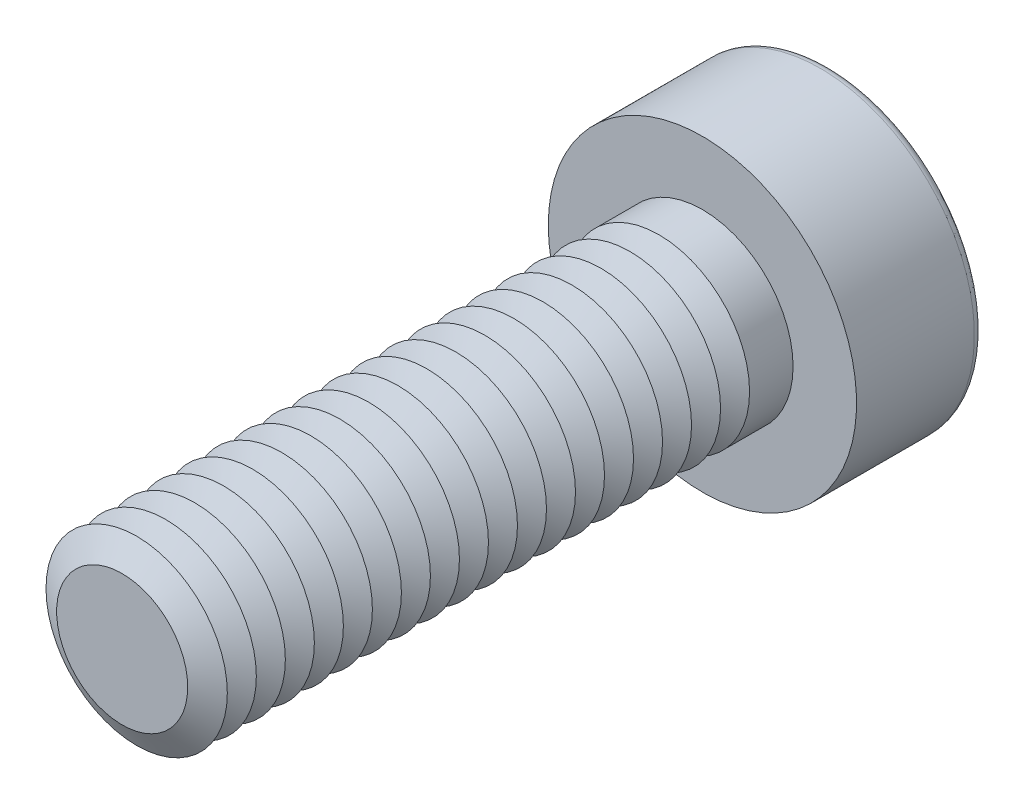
from build123d import *

# Parameters (mm, degrees)
SKETCH1_R           = 2.5
BOSS_EXTRUDE1_DEPTH = 16
SKETCH2_R           = 4.25
BOSS_EXTRUDE2_DEPTH = 3.5
CUT_EXTRUDE1_DEPTH  = 2.25
FILLET1_R           = 0.25
LPATTERN1_COUNT     = 19
LPATTERN1_PITCH     = 0.8


with BuildPart() as part:
    # Sketch1 → Boss-Extrude1 (new body)
    with BuildSketch(Plane.XY):
        Circle(SKETCH1_R)
    extrude(amount=BOSS_EXTRUDE1_DEPTH)

    # Sketch2 → Boss-Extrude2 (add)
    with BuildSketch(Plane(origin=(0, 0, 0), x_dir=(-1, 0, 0), z_dir=(0, 0, -1))):
        Circle(SKETCH2_R)
    extrude(amount=BOSS_EXTRUDE2_DEPTH)

    # Sketch3 → Cut-Extrude1 (cut)
    with BuildSketch(Plane(origin=(0, 0, -3.5), x_dir=(-1, 0, 0), z_dir=(0, 0, -1))):
        Polygon((-0.866025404, 1.5), (-1.732050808, 0), (-0.866025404, -1.5), (0.866025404, -1.5), (1.732050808, 0), (0.866025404, 1.5), align=None)
    extrude(amount=-CUT_EXTRUDE1_DEPTH, mode=Mode.SUBTRACT)

    # Fillet1
    fillet1_edges = [part.edges().sort_by_distance(p)[0] for p in [
        (4.25, 0, -3.5),
    ]]
    fillet(fillet1_edges, radius=FILLET1_R)

    # Cut-Extrude2 cone 1 section (on through the dimple's axis) → Cut-Extrude2 (revolve, cut)
    with BuildSketch(Plane(origin=(0, 0, -1.25), x_dir=(0, 1, 0), z_dir=(1, 0, 0))):
        Polygon((0, 0), (1.5, 0), (0, 0.866025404), align=None)
    revolve(axis=Axis((0, 0, -1.25), (0, 0, 1)), mode=Mode.SUBTRACT)

    # Cut-Extrude3 cone 1 section (on through the dimple's axis) → Cut-Extrude3 (revolve, cut)
    with BuildSketch(Plane(origin=(0, 0, -3.5), x_dir=(0, 1, 0), z_dir=(1, 0, 0))):
        Polygon((0, 0), (1.732050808, 0), (0, 0.464101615), align=None)
    revolve(axis=Axis((0, 0, -3.5), (0, 0, 1)), mode=Mode.SUBTRACT)

    # Sketch7 → Cut-Revolve1 (revolve, cut)
    with BuildSketch(Plane(origin=(0, 0, 0), x_dir=(0, 0, -1), z_dir=(1, 0, 0)), mode=Mode.PRIVATE) as cut_revolve1_sk:
        Polygon((-16, 1.807179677), (-15.6, 2.5), (-16.4, 2.5), align=None)
    cut_revolve1 = revolve(cut_revolve1_sk.sketch.rotate(Axis((0, 0, 16), (0, 0, -1)), 90), axis=Axis((0, 0, 16), (0, 0, -1)), mode=Mode.SUBTRACT)

    # LPattern1: Cut-Revolve1 ×19
    with Locations(*[(0, 0, -i * LPATTERN1_PITCH) for i in range(1, LPATTERN1_COUNT)]):
        add(cut_revolve1, mode=Mode.SUBTRACT)


solid = part.part
